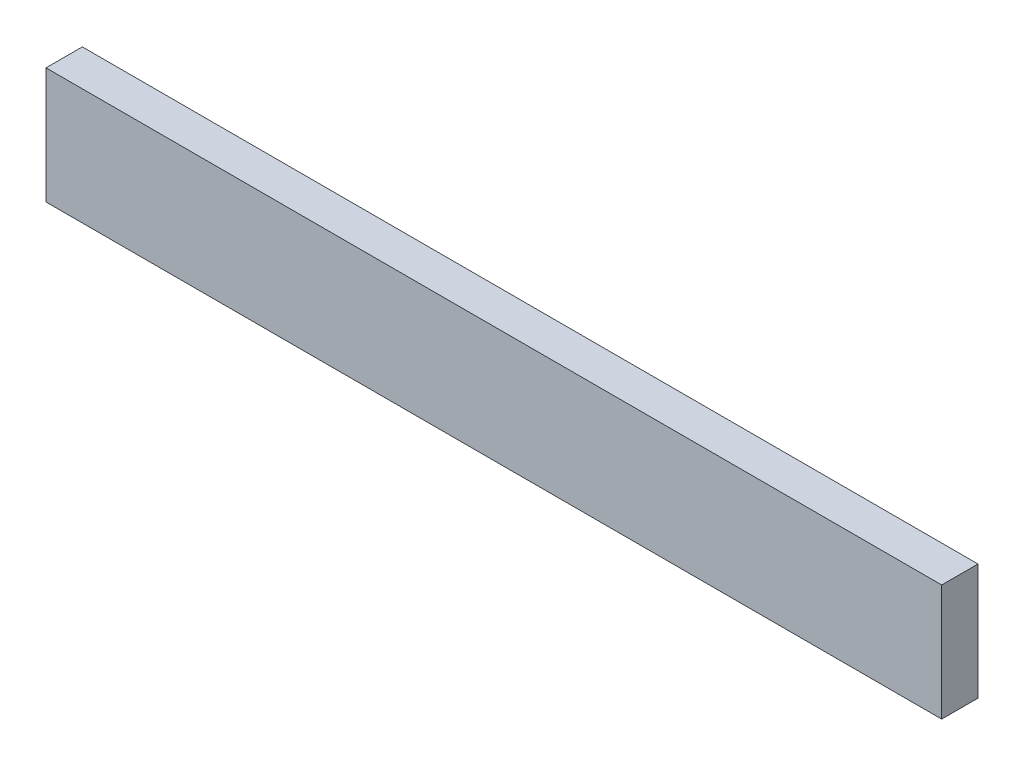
from build123d import *

# Parameters (mm, degrees)
SKETCH_1_W      = 370
SKETCH_1_H      = 48
EXTRUDE_1_DEPTH = 15


with BuildPart() as part:
    # Sketch 1 → Extrude 1 (new body)
    with BuildSketch(Plane.XY):
        with Locations((185, 24)):
            Rectangle(SKETCH_1_W, SKETCH_1_H)
    extrude(amount=EXTRUDE_1_DEPTH)


solid = part.part
